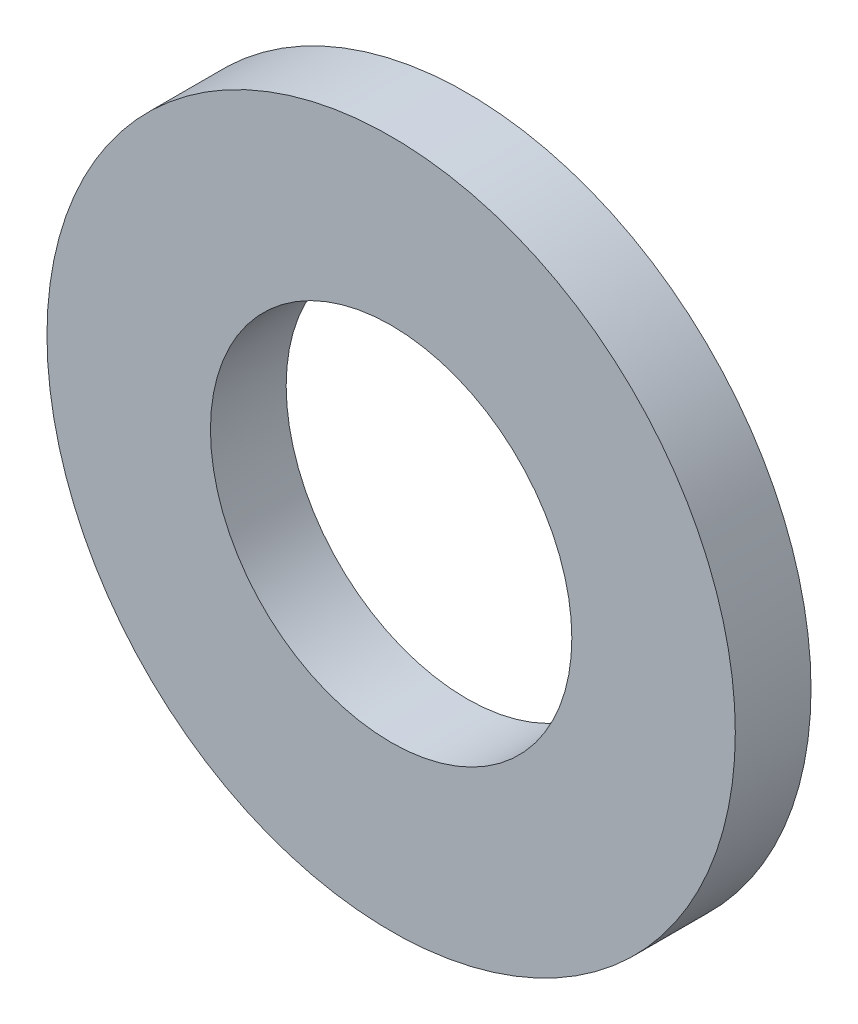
from build123d import *

# Parameters (mm, degrees)
SKETCH1_R           = 10
SKETCH1_R_2         = 5.25
BOSS_EXTRUDE1_DEPTH = 2.2


with BuildPart() as part:
    # Sketch1 → Boss-Extrude1 (new body)
    with BuildSketch(Plane.XY):
        Circle(SKETCH1_R)
        Circle(SKETCH1_R_2, mode=Mode.SUBTRACT)
    extrude(amount=BOSS_EXTRUDE1_DEPTH)


solid = part.part
